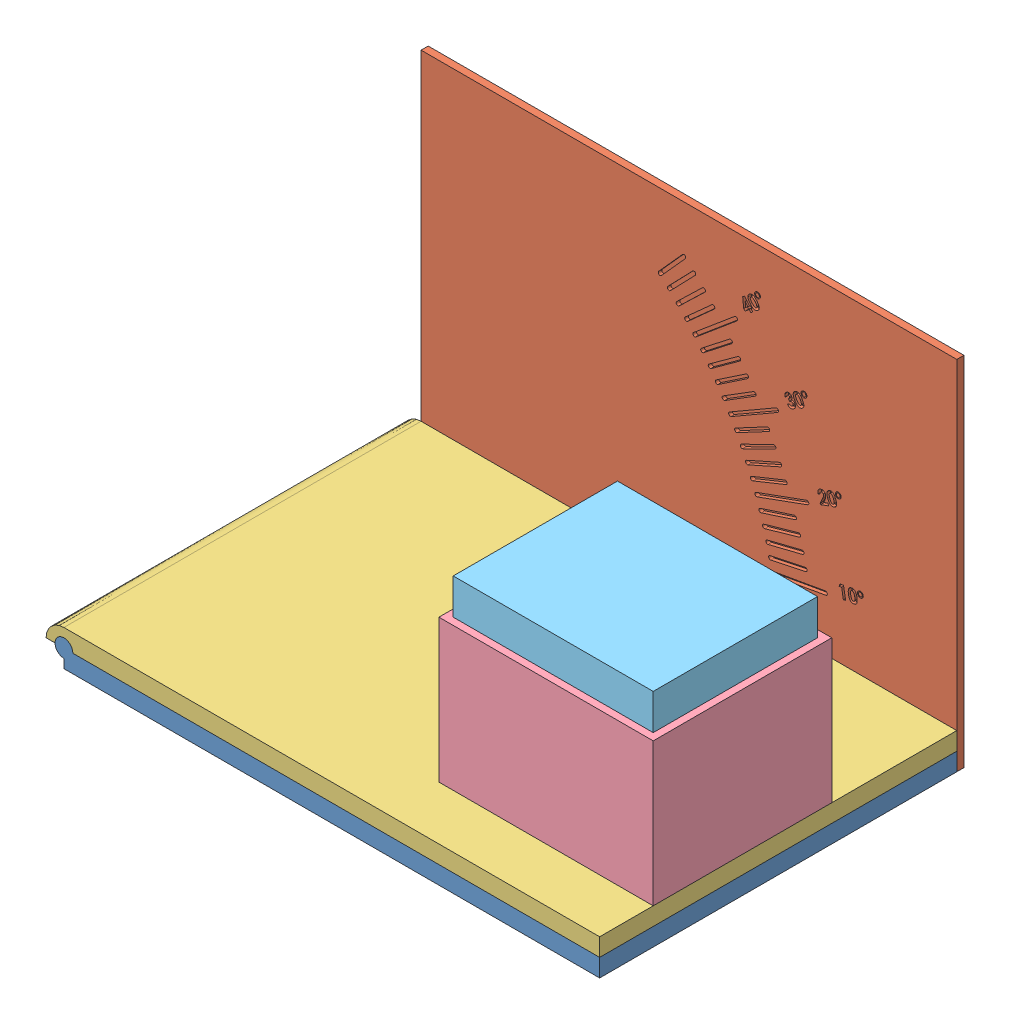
SolidWorks assembly etude_frottement.SLDASM, configuration Défaut (file format 9000). Lengths in mm.
Overall size (155 100 102).
6 component instances, 5 part files, 15 mates.
Components (placement in the parent):
- SE Support-1: SE Support.SLDASM [Défaut] at (16.917 -39.3849 0) size (152.5 100 102)
  - Plaque fixe-1: Plaque fixe.SLDPRT [Défaut] at (-73.3328 -10.641 0) size (152.5 7.5 100)
  - Graduation-1: Graduation.SLDPRT [Défaut] at (-73.3328 -10.641 -50) size (150 100 2)
- Plaque mobile-1: Plaque mobile.SLDPRT [Défaut] at (-56.4158 -45.0259 0) size (155 5 100)
- contenant-1: contenant.SLDPRT [Défaut] at (33.5842 -45.0259 10) size (60 40 50)
- piece_fixe-1: piece_fixe.SLDPRT [Défaut] at (0 91.591 -0.1167) size (56 48 46)
Mates (geometry in assembly coordinates):
- Coaxiale2: concentric: cylinder of SE Support-1/Plaque fixe-1 through (-56.4158 -50.0259 -57.0711) axis (0 0 1) radius 2.5; cylinder of Plaque mobile-1 through (-56.4158 -50.0259 -50) axis (0 0 1) radius 2.5
- Coïncidente1: coincident: plane of Plaque mobile-1 through (-56.4158 -50.0259 50) normal (0 0 1); plane of SE Support-1/Plaque fixe-1 through (-56.4158 -55.0259 50) normal (0 0 1)
- Parallèle1: parallel anti-aligned: plane of SE Support-1/Plaque fixe-1 through (-56.4158 -55.0259 50) normal (0 -1 0); plane of Plaque mobile-1 through (-56.4158 -45.0259 50) normal (0 1 0)
- Coïncidente3: coincident aligned: plane of Plaque mobile-1 through (-56.4158 -50.0259 50) normal (0 0 1); plane of contenant-1 through (33.5842 -5.0259 35) normal (0 0 1)
- Coïncidente4: coincident anti-aligned: plane of Plaque mobile-1 through (-56.4158 -45.0259 50) normal (0 1 0); plane of contenant-1 through (33.5842 -45.0259 50) normal (0 -1 0)
- Coïncidente5: coincident aligned: plane of Plaque mobile-1 through (93.5842 -45.0259 50) normal (1 0 0); plane of contenant-1 through (93.5842 -45.0259 35) normal (1 0 0)
- Coaxiale3: concentric aligned: cylinder of SE Support-1/Plaque fixe-1 through (-56.4158 -50.0259 -57.0711) axis (0 0 1) radius 2.5; cylinder of Plaque mobile-1 through (-56.4158 -50.0259 -50) axis (0 0 1) radius 2.5
- Coïncidente6: coincident aligned: plane of SE Support-1/Plaque fixe-1 through (-56.4158 -55.0259 50) normal (0 0 1); plane of Plaque mobile-1 through (-56.4158 -50.0259 50) normal (0 0 1)
- Coïncidente7: coincident anti-aligned: plane of Plaque mobile-1 through (-56.4158 -45.0259 50) normal (0 1 0); plane of contenant-1 through (33.5842 -45.0259 35) normal (0 -1 0)
- Coïncidente8: coincident aligned: plane of Plaque mobile-1 through (93.5842 -45.0259 50) normal (1 0 0); plane of contenant-1 through (93.5842 -45.0259 35) normal (1 0 0)
- Distance2: distance = 15 mm aligned: plane of Plaque mobile-1 through (-56.4158 -50.0259 50) normal (0 0 1); plane of contenant-1 through (33.5842 -5.0259 35) normal (0 0 1)
- Coïncidente11: coincident anti-aligned: plane of contenant-1 through (35.5842 -43.0259 -13) normal (1 0 0); plane of piece_fixe-1 through (35.5842 4.9741 -13) normal (-1 0 0)
- Coïncidente12: coincident anti-aligned: plane of contenant-1 through (35.5842 -43.0259 33) normal (0 0 -1); plane of piece_fixe-1 through (35.5842 4.9741 33) normal (0 0 1)
- Coïncidente13: coincident anti-aligned: plane of contenant-1 through (33.5842 -43.0259 10) normal (0 1 0); plane of piece_fixe-1 through (0 -43.0259 -0.1167) normal (0 -1 0)
- Angle1: planar angle anti-aligned: plane of SE Support-1/Plaque fixe-1 through (-56.4158 -50.0259 50) normal (0 1 0); plane of Plaque mobile-1 through (-56.4158 -50.0259 50) normal (0 -1 0)
